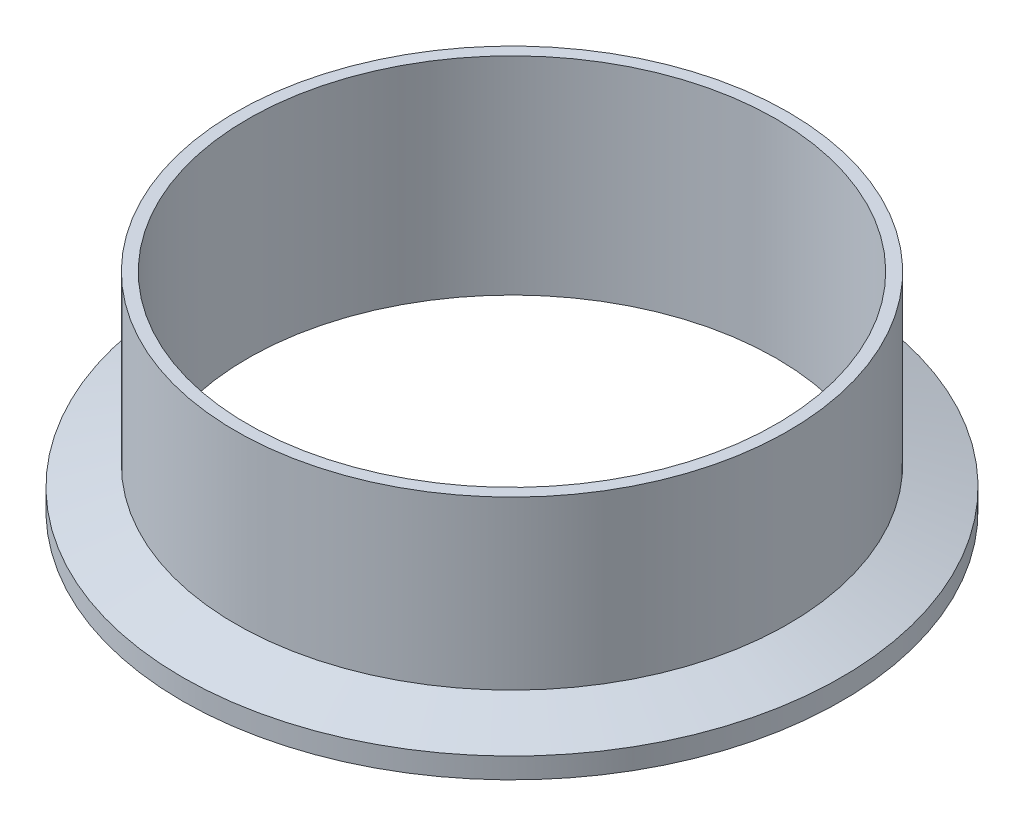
from build123d import *


with BuildPart() as part:
    # Sketch1 → Revolve2 (revolve)
    with BuildSketch(Plane.XY, mode=Mode.PRIVATE) as revolve2_sk:
        with BuildLine():
            Line((-36.449, 0), (-36.449, 28.575))
            Line((-36.449, 28.575), (-38.1, 28.575))
            Line((-38.1, 28.575), (-38.1, 5.521182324))
            Line((-38.1, 5.521182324), (-45.4533, 2.8448))
            Line((-45.4533, 2.8448), (-45.4533, 0))
            Line((-45.4533, 0), (-43.486708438, 0))
            ThreePointArc((-43.486708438, 0), (-43.054511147, 0.129217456), (-42.764166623, 0.474458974))
            ThreePointArc((-42.764166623, 0.474458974), (-41.6687, 1.1938), (-40.573233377, 0.474458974))
            ThreePointArc((-40.573233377, 0.474458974), (-40.282888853, 0.129217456), (-39.850691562, 0))
            Line((-39.850691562, 0), (-36.449, 0))
        make_face()
    revolve(revolve2_sk.sketch.rotate(Axis((0, 0, 0), (0, 1, 0)), 270), axis=Axis((0, 0, 0), (0, 1, 0)))


solid = part.part
